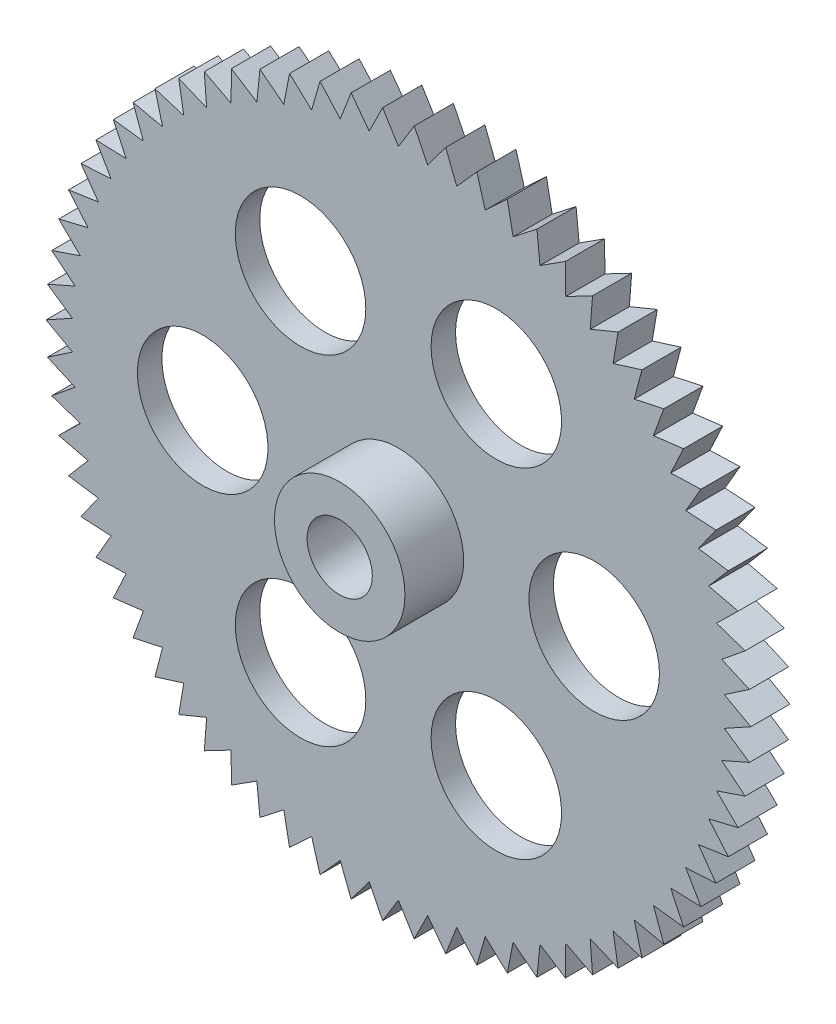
from build123d import *

# Parameters (mm, degrees)
ESQUISSE2_R                  = 2
EXTRUSION1_DEPTH             = 16.379206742
R_P_TITION_CIRCULAIRE1_COUNT = 6
EXTRUSION2_DEPTH             = 16.379206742
R_P_TITION_CIRCULAIRE2_COUNT = 70


with BuildPart() as part:
    # Esquisse1 → R_volution1 (revolve)
    with BuildSketch(Plane(origin=(0, 0, 0), x_dir=(0, 0, -1), z_dir=(1, 0, 0)), mode=Mode.PRIVATE) as r_volution1_sk:
        Polygon((0, 1), (0, 2), (1.8, 2), (1.8, 10.8), (3, 10.8), (3, 9), (2.55, 9), (2.55, 2), (3.55, 2), (3.55, 1), align=None)
    revolve(r_volution1_sk.sketch.rotate(Axis((0, 0, 0), (0, 0, -1)), 90), axis=Axis((0, 0, 0), (0, 0, -1)))

    # Esquisse2 → Extrusion1 (cut, through all)
    with BuildSketch(Plane.XY.offset(-1.8)):
        with Locations((6, 0)):
            Circle(ESQUISSE2_R)
    extrusion1 = extrude(amount=-EXTRUSION1_DEPTH, mode=Mode.SUBTRACT)

    # R_p_tition circulaire1: Extrusion1 ×6 about axis
    r_p_tition_circulaire1_axis = Axis((0, 0, 0), (0, 0, 1))
    for i in range(1, R_P_TITION_CIRCULAIRE1_COUNT):
        add(extrusion1.rotate(r_p_tition_circulaire1_axis, i * 360 / R_P_TITION_CIRCULAIRE1_COUNT), mode=Mode.SUBTRACT)

    # Esquisse3 → Extrusion2 (cut, through all)
    with BuildSketch(Plane.XY.offset(-1.8)):
        with BuildLine():
            Line((10.8, 0), (9.989930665, 0.448648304))
            Line((9.989930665, 0.448648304), (10.756522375, 0.968104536))
            ThreePointArc((10.756522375, 0.968104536), (10.789125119, 0.484540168), (10.8, 0))
        make_face()
    extrusion2 = extrude(amount=-EXTRUSION2_DEPTH, mode=Mode.SUBTRACT)

    # R_p_tition circulaire2: Extrusion2 ×70 about axis
    r_p_tition_circulaire2_axis = Axis((0, 0, 0), (0, 0, 1))
    for i in range(1, R_P_TITION_CIRCULAIRE2_COUNT):
        add(extrusion2.rotate(r_p_tition_circulaire2_axis, i * 360 / R_P_TITION_CIRCULAIRE2_COUNT), mode=Mode.SUBTRACT)


solid = part.part
